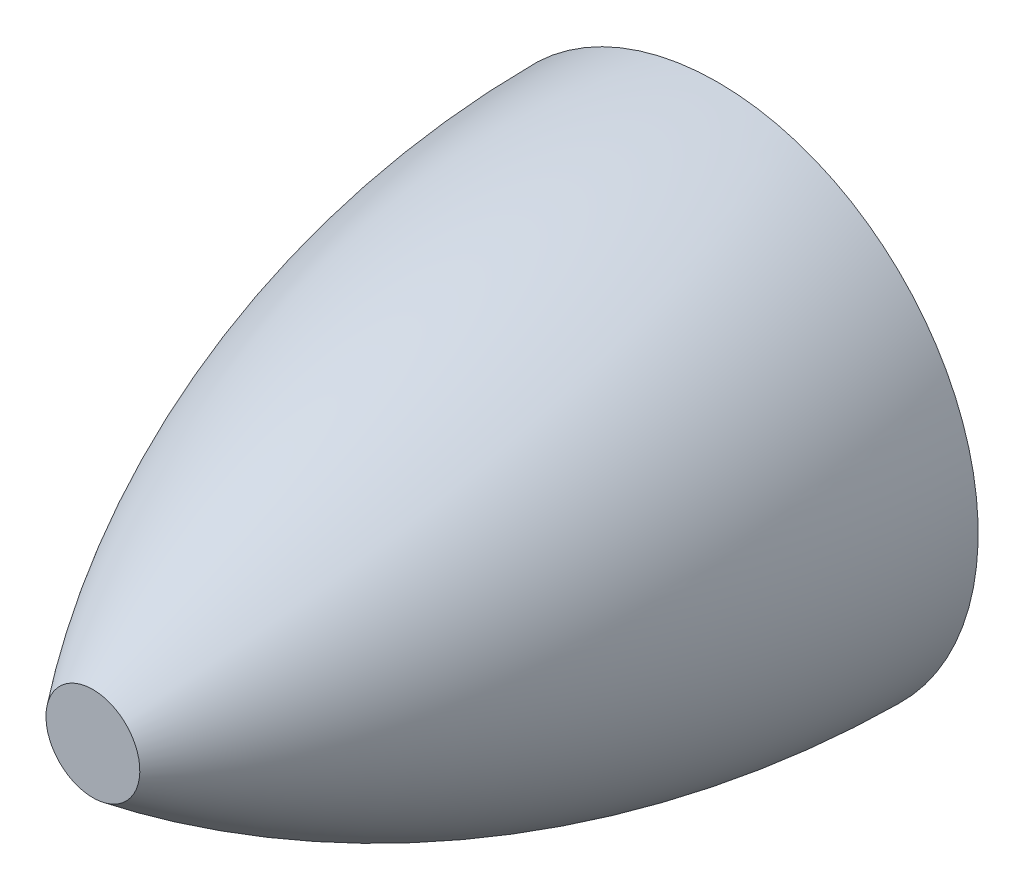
ISO-10303-21;
HEADER;
FILE_DESCRIPTION(('STEP AP214'),'2;1');
FILE_NAME('part.step','',(''),(''),'','','');
FILE_SCHEMA(('AUTOMOTIVE_DESIGN { 1 0 10303 214 1 1 1 1 }'));
ENDSEC;
DATA;
#1=APPLICATION_CONTEXT('core data for automotive mechanical design processes');
#2=APPLICATION_PROTOCOL_DEFINITION('international standard','automotive_design',2000,#1);
#3=PRODUCT_CONTEXT('',#1,'mechanical');
#4=PRODUCT('Part','Part','',(#3));
#5=PRODUCT_RELATED_PRODUCT_CATEGORY('part','',(#4));
#6=PRODUCT_DEFINITION_FORMATION('','',#4);
#7=PRODUCT_DEFINITION_CONTEXT('part definition',#1,'design');
#8=PRODUCT_DEFINITION('design','',#6,#7);
#9=PRODUCT_DEFINITION_SHAPE('','',#8);
#10=(LENGTH_UNIT() NAMED_UNIT(*) SI_UNIT(.MILLI.,.METRE.));
#11=(NAMED_UNIT(*) PLANE_ANGLE_UNIT() SI_UNIT($,.RADIAN.));
#12=(NAMED_UNIT(*) SI_UNIT($,.STERADIAN.) SOLID_ANGLE_UNIT());
#13=UNCERTAINTY_MEASURE_WITH_UNIT(LENGTH_MEASURE(1.E-05),#10,'distance_accuracy_value','');
#14=(GEOMETRIC_REPRESENTATION_CONTEXT(3) GLOBAL_UNCERTAINTY_ASSIGNED_CONTEXT((#13)) GLOBAL_UNIT_ASSIGNED_CONTEXT((#10,
#11,#12)) REPRESENTATION_CONTEXT('',''));
#15=CARTESIAN_POINT('',(0.,0.,0.));
#16=DIRECTION('',(0.,0.,1.));
#17=DIRECTION('',(1.,0.,0.));
#18=AXIS2_PLACEMENT_3D('',#15,#16,#17);
#19=CARTESIAN_POINT('',(0.,0.,6.));
#20=DIRECTION('',(0.,0.,-1.));
#21=DIRECTION('',(0.,1.,0.));
#22=AXIS2_PLACEMENT_3D('',#19,#20,#21);
#23=CYLINDRICAL_SURFACE('',#22,3.);
#24=CARTESIAN_POINT('',(0.,0.,6.));
#25=DIRECTION('',(0.,0.,-1.));
#26=DIRECTION('',(0.,1.,0.));
#27=AXIS2_PLACEMENT_3D('',#24,#25,#26);
#28=CIRCLE('',#27,3.);
#29=CARTESIAN_POINT('',(0.,3.,6.));
#30=VERTEX_POINT('',#29);
#31=EDGE_CURVE('E23',#30,#30,#28,.T.);
#32=ORIENTED_EDGE('',*,*,#31,.F.);
#33=EDGE_LOOP('',(#32));
#34=FACE_BOUND('',#33,.T.);
#35=CARTESIAN_POINT('',(0.,0.,0.));
#36=DIRECTION('',(0.,0.,-1.));
#37=DIRECTION('',(0.,1.,0.));
#38=AXIS2_PLACEMENT_3D('',#35,#36,#37);
#39=CIRCLE('',#38,3.);
#40=CARTESIAN_POINT('',(0.,3.,0.));
#41=VERTEX_POINT('',#40);
#42=EDGE_CURVE('E27',#41,#41,#39,.T.);
#43=ORIENTED_EDGE('',*,*,#42,.T.);
#44=EDGE_LOOP('',(#43));
#45=FACE_BOUND('',#44,.T.);
#46=ADVANCED_FACE('F12',(#34,#45),#23,.F.);
#47=CARTESIAN_POINT('',(0.,0.,6.));
#48=DIRECTION('',(0.,0.,-1.));
#49=DIRECTION('',(0.,1.,0.));
#50=AXIS2_PLACEMENT_3D('',#47,#48,#49);
#51=PLANE('',#50);
#52=ORIENTED_EDGE('',*,*,#31,.T.);
#53=EDGE_LOOP('',(#52));
#54=FACE_BOUND('',#53,.T.);
#55=ADVANCED_FACE('F44',(#54),#51,.T.);
#56=CARTESIAN_POINT('',(0.,0.,24.));
#57=DIRECTION('',(0.,0.,-1.));
#58=DIRECTION('',(0.,1.,0.));
#59=AXIS2_PLACEMENT_3D('',#56,#57,#58);
#60=PLANE('',#59);
#61=CARTESIAN_POINT('',(0.,0.,24.));
#62=DIRECTION('',(0.,0.,-1.));
#63=DIRECTION('',(0.,1.,0.));
#64=AXIS2_PLACEMENT_3D('',#61,#62,#63);
#65=CIRCLE('',#64,1.80180180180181);
#66=CARTESIAN_POINT('',(0.,1.80180180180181,24.));
#67=VERTEX_POINT('',#66);
#68=EDGE_CURVE('E8',#67,#67,#65,.T.);
#69=ORIENTED_EDGE('',*,*,#68,.F.);
#70=EDGE_LOOP('',(#69));
#71=FACE_BOUND('',#70,.T.);
#72=ADVANCED_FACE('F14',(#71),#60,.F.);
#73=CARTESIAN_POINT('',(0.,0.,-0.263150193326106));
#74=DIRECTION('',(0.,0.,-1.));
#75=DIRECTION('',(0.,1.,0.));
#76=AXIS2_PLACEMENT_3D('',#73,#74,#75);
#77=DEGENERATE_TOROIDAL_SURFACE('',#76,29.9991343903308,40.,.F.);
#78=ORIENTED_EDGE('',*,*,#68,.T.);
#79=EDGE_LOOP('',(#78));
#80=FACE_BOUND('',#79,.T.);
#81=CARTESIAN_POINT('',(0.,0.,-2.79507320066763E-13));
#82=DIRECTION('',(0.,0.,-1.));
#83=DIRECTION('',(0.,1.,0.));
#84=AXIS2_PLACEMENT_3D('',#81,#82,#83);
#85=CIRCLE('',#84,10.);
#86=CARTESIAN_POINT('',(0.,10.,-2.79507320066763E-13));
#87=VERTEX_POINT('',#86);
#88=EDGE_CURVE('E19',#87,#87,#85,.T.);
#89=ORIENTED_EDGE('',*,*,#88,.F.);
#90=EDGE_LOOP('',(#89));
#91=FACE_BOUND('',#90,.T.);
#92=ADVANCED_FACE('F36',(#80,#91),#77,.F.);
#93=CARTESIAN_POINT('',(10.,0.,-1.39753660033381E-13));
#94=DIRECTION('',(0.,0.,1.));
#95=DIRECTION('',(0.,-1.,0.));
#96=AXIS2_PLACEMENT_3D('',#93,#94,#95);
#97=PLANE('',#96);
#98=ORIENTED_EDGE('',*,*,#42,.F.);
#99=EDGE_LOOP('',(#98));
#100=FACE_BOUND('',#99,.T.);
#101=ORIENTED_EDGE('',*,*,#88,.T.);
#102=EDGE_LOOP('',(#101));
#103=FACE_BOUND('',#102,.T.);
#104=ADVANCED_FACE('F34',(#100,#103),#97,.F.);
#105=CLOSED_SHELL('',(#46,#55,#72,#92,#104));
#106=MANIFOLD_SOLID_BREP('B1',#105);
#107=ADVANCED_BREP_SHAPE_REPRESENTATION('',(#18,#106),#14);
#108=SHAPE_DEFINITION_REPRESENTATION(#9,#107);
ENDSEC;
END-ISO-10303-21;
